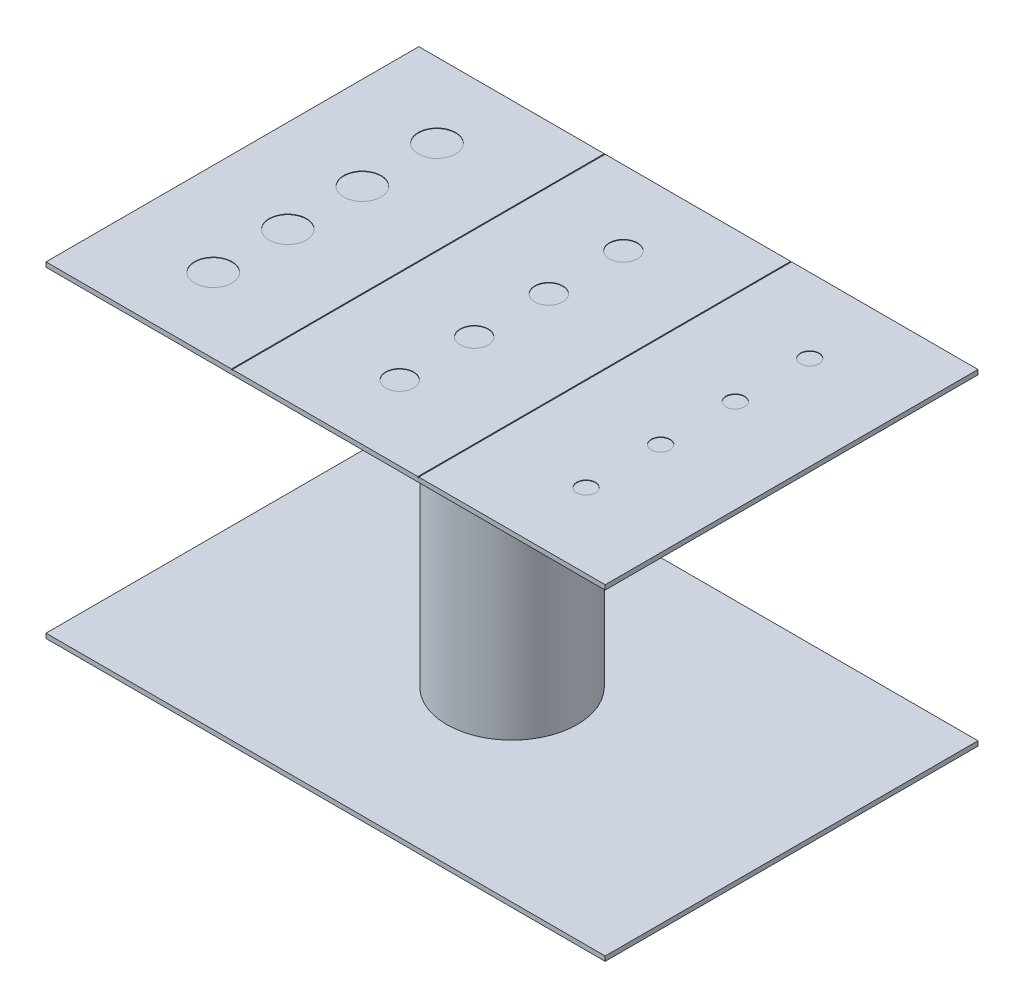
from build123d import *

# Parameters (mm, degrees)
SKETCH1_W               = 600
SKETCH1_H               = 400
BOSS_EXTRUDE1_DEPTH     = 5
SKETCH2_R               = 70
BOSS_EXTRUDE2_DEPTH     = 340
SKETCH3_W               = 600
SKETCH3_H               = 400
BOSS_EXTRUDE3_DEPTH     = 5
SKETCH4_W               = 1
SKETCH4_H               = 400
CUT_EXTRUDE_THIN1_DEPTH = 1
SKETCH6_R               = 20
SKETCH6_R_2             = 15
SKETCH6_R_3             = 10
CUT_EXTRUDE1_DEPTH      = 0.5


with BuildPart() as part:
    # Sketch1 → Boss-Extrude1 (new body)
    with BuildSketch(Plane(origin=(0, 0, 0), x_dir=(1, 0, 0), z_dir=(0, 1, 0))):
        Rectangle(SKETCH1_W, SKETCH1_H)
    extrude(amount=BOSS_EXTRUDE1_DEPTH)

    # Sketch2 → Boss-Extrude2 (add)
    with BuildSketch(Plane(origin=(0, 5, 0), x_dir=(1, 0, 0), z_dir=(0, 1, 0))):
        with Locations(Location((0, 0, 0), (0, 0, 270))):
            Circle(SKETCH2_R)
    extrude(amount=BOSS_EXTRUDE2_DEPTH)

    # Sketch3 → Boss-Extrude3 (add)
    with BuildSketch(Plane(origin=(0, 345, 0), x_dir=(1, 0, 0), z_dir=(0, 1, 0))):
        Rectangle(SKETCH3_W, SKETCH3_H)
    extrude(amount=BOSS_EXTRUDE3_DEPTH)

    # Sketch4 → Cut-Extrude-Thin1 (cut)
    with BuildSketch(Plane(origin=(0, 350, 0), x_dir=(1, 0, 0), z_dir=(0, 1, 0))):
        with Locations((99.5, 0)):
            Rectangle(SKETCH4_W, SKETCH4_H)
        with Locations((-100.5, 0)):
            Rectangle(SKETCH4_W, SKETCH4_H)
    extrude(amount=-CUT_EXTRUDE_THIN1_DEPTH, mode=Mode.SUBTRACT)

    # Sketch6 → Cut-Extrude1 (cut)
    with BuildSketch(Plane(origin=(0, 350, 0), x_dir=(1, 0, 0), z_dir=(0, 1, 0))):
        with Locations(Location((-200.5, -120, 0), (0, 0, 270))):
            Circle(SKETCH6_R)
        with Locations(Location((-0.5, -120, 0), (0, 0, 270))):
            Circle(SKETCH6_R_2)
        with Locations(Location((199.5, -120, 0), (0, 0, 270))):
            Circle(SKETCH6_R_3)
        with Locations(Location((-200.5, -40, 0), (0, 0, 270))):
            Circle(SKETCH6_R)
        with Locations(Location((-0.5, -40, 0), (0, 0, 270))):
            Circle(SKETCH6_R_2)
        with Locations(Location((199.5, -40, 0), (0, 0, 270))):
            Circle(SKETCH6_R_3)
        with Locations(Location((-200.5, 40, 0), (0, 0, 270))):
            Circle(SKETCH6_R)
        with Locations(Location((-0.5, 40, 0), (0, 0, 270))):
            Circle(SKETCH6_R_2)
        with Locations(Location((199.5, 40, 0), (0, 0, 270))):
            Circle(SKETCH6_R_3)
        with Locations(Location((-200.5, 120, 0), (0, 0, 270))):
            Circle(SKETCH6_R)
        with Locations(Location((-0.5, 120, 0), (0, 0, 270))):
            Circle(SKETCH6_R_2)
        with Locations(Location((199.5, 120, 0), (0, 0, 270))):
            Circle(SKETCH6_R_3)
    extrude(amount=-CUT_EXTRUDE1_DEPTH, mode=Mode.SUBTRACT)


solid = part.part
